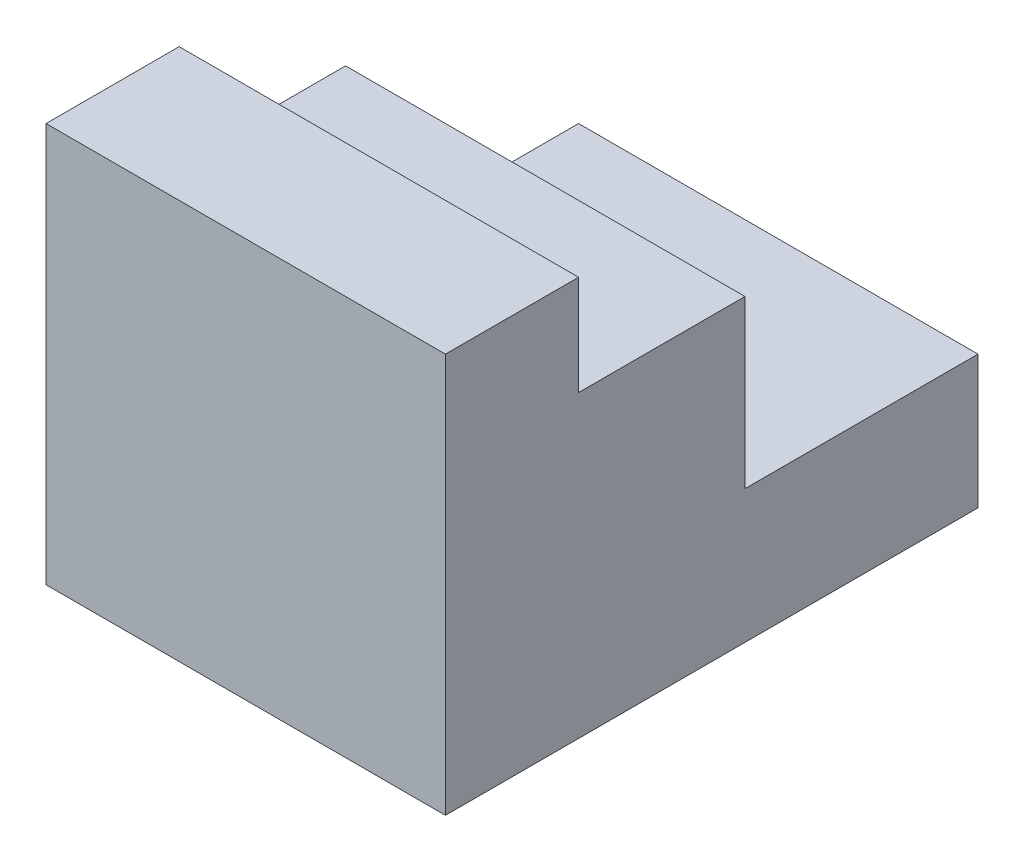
from build123d import *

# Parameters (mm, degrees)
AUFSATZ_LINEAR_AUSTRAGEN1_DEPTH = 60


with BuildPart() as part:
    # Skizze1 → Aufsatz-Linear austragen1 (new body)
    with BuildSketch(Plane(origin=(0, 0, 0), x_dir=(0, 0, -1), z_dir=(1, 0, 0))):
        Polygon((0, 0), (0, 60), (20, 60), (20, 45), (45, 45), (45, 20), (80, 20), (80, 0), align=None)
    extrude(amount=AUFSATZ_LINEAR_AUSTRAGEN1_DEPTH)


solid = part.part
